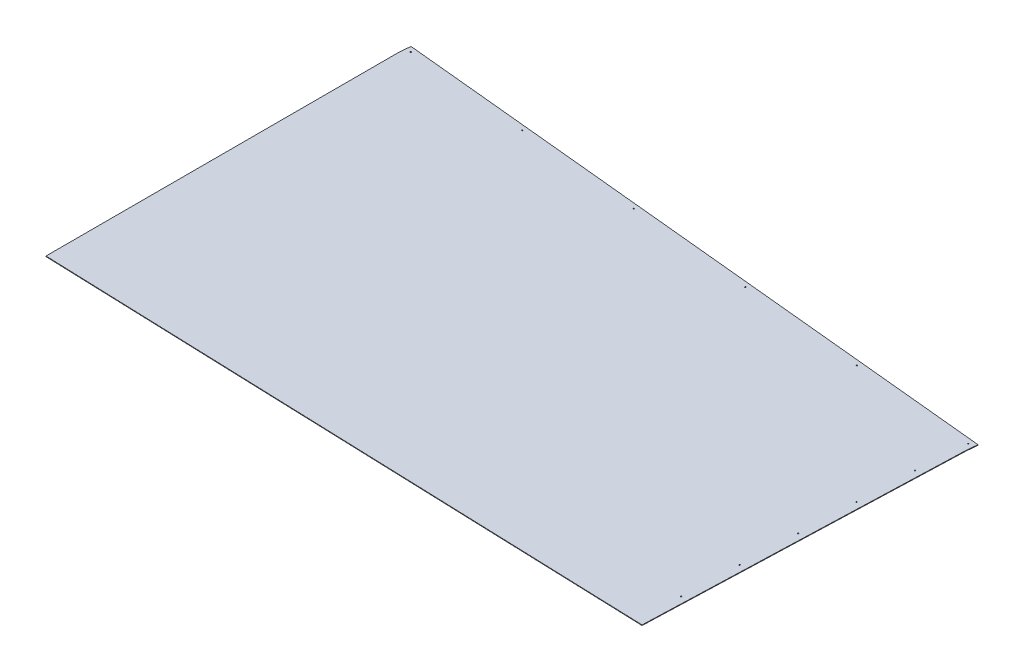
ISO-10303-21;
HEADER;
FILE_DESCRIPTION(('STEP AP214'),'2;1');
FILE_NAME('part.step','',(''),(''),'','','');
FILE_SCHEMA(('AUTOMOTIVE_DESIGN { 1 0 10303 214 1 1 1 1 }'));
ENDSEC;
DATA;
#1=APPLICATION_CONTEXT('core data for automotive mechanical design processes');
#2=APPLICATION_PROTOCOL_DEFINITION('international standard','automotive_design',2000,#1);
#3=PRODUCT_CONTEXT('',#1,'mechanical');
#4=PRODUCT('Part','Part','',(#3));
#5=PRODUCT_RELATED_PRODUCT_CATEGORY('part','',(#4));
#6=PRODUCT_DEFINITION_FORMATION('','',#4);
#7=PRODUCT_DEFINITION_CONTEXT('part definition',#1,'design');
#8=PRODUCT_DEFINITION('design','',#6,#7);
#9=PRODUCT_DEFINITION_SHAPE('','',#8);
#10=(LENGTH_UNIT() NAMED_UNIT(*) SI_UNIT(.MILLI.,.METRE.));
#11=(NAMED_UNIT(*) PLANE_ANGLE_UNIT() SI_UNIT($,.RADIAN.));
#12=(NAMED_UNIT(*) SI_UNIT($,.STERADIAN.) SOLID_ANGLE_UNIT());
#13=UNCERTAINTY_MEASURE_WITH_UNIT(LENGTH_MEASURE(1.E-05),#10,'distance_accuracy_value','');
#14=(GEOMETRIC_REPRESENTATION_CONTEXT(3) GLOBAL_UNCERTAINTY_ASSIGNED_CONTEXT((#13)) GLOBAL_UNIT_ASSIGNED_CONTEXT((#10,
#11,#12)) REPRESENTATION_CONTEXT('',''));
#15=CARTESIAN_POINT('',(0.,0.,0.));
#16=DIRECTION('',(0.,0.,1.));
#17=DIRECTION('',(1.,0.,0.));
#18=AXIS2_PLACEMENT_3D('',#15,#16,#17);
#19=CARTESIAN_POINT('',(-2536.23276450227,-2.5399999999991,-1605.09933253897));
#20=DIRECTION('',(0.,1.,0.));
#21=DIRECTION('',(-0.995256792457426,0.,-0.0972826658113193));
#22=AXIS2_PLACEMENT_3D('',#19,#20,#21);
#23=CYLINDRICAL_SURFACE('',#22,1.58749999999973);
#24=CARTESIAN_POINT('',(-2536.23276450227,8.88178419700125E-13,-1605.09933253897));
#25=DIRECTION('',(0.,1.,0.));
#26=DIRECTION('',(-0.995256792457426,0.,-0.0972826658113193));
#27=AXIS2_PLACEMENT_3D('',#24,#25,#26);
#28=CIRCLE('',#27,1.58749999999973);
#29=CARTESIAN_POINT('',(-2537.8127346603,8.90425580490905E-13,-1605.25376877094));
#30=VERTEX_POINT('',#29);
#31=EDGE_CURVE('E198',#30,#30,#28,.T.);
#32=ORIENTED_EDGE('',*,*,#31,.T.);
#33=EDGE_LOOP('',(#32));
#34=FACE_BOUND('',#33,.T.);
#35=CARTESIAN_POINT('',(-2536.23276450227,-1.62559999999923,-1605.09933253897));
#36=DIRECTION('',(0.,1.,0.));
#37=DIRECTION('',(-0.995256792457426,0.,-0.0972826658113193));
#38=AXIS2_PLACEMENT_3D('',#35,#36,#37);
#39=CIRCLE('',#38,1.58749999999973);
#40=CARTESIAN_POINT('',(-2537.8127346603,-1.62559999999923,-1605.25376877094));
#41=VERTEX_POINT('',#40);
#42=EDGE_CURVE('E202',#41,#41,#39,.T.);
#43=ORIENTED_EDGE('',*,*,#42,.F.);
#44=EDGE_LOOP('',(#43));
#45=FACE_BOUND('',#44,.T.);
#46=ADVANCED_FACE('F99',(#34,#45),#23,.F.);
#47=CARTESIAN_POINT('',(-2182.31944910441,-2.53999999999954,-1570.50561657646));
#48=DIRECTION('',(0.,1.,0.));
#49=DIRECTION('',(-0.995256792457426,0.,-0.0972826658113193));
#50=AXIS2_PLACEMENT_3D('',#47,#48,#49);
#51=CYLINDRICAL_SURFACE('',#50,1.58750000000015);
#52=CARTESIAN_POINT('',(-2182.31944910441,4.44089209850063E-13,-1570.50561657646));
#53=DIRECTION('',(0.,1.,0.));
#54=DIRECTION('',(-0.995256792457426,0.,-0.0972826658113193));
#55=AXIS2_PLACEMENT_3D('',#52,#53,#54);
#56=CIRCLE('',#55,1.58750000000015);
#57=CARTESIAN_POINT('',(-2183.89941926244,4.46336370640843E-13,-1570.66005280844));
#58=VERTEX_POINT('',#57);
#59=EDGE_CURVE('E241',#58,#58,#56,.T.);
#60=ORIENTED_EDGE('',*,*,#59,.T.);
#61=EDGE_LOOP('',(#60));
#62=FACE_BOUND('',#61,.T.);
#63=CARTESIAN_POINT('',(-2182.31944910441,-1.62560000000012,-1570.50561657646));
#64=DIRECTION('',(0.,1.,0.));
#65=DIRECTION('',(-0.995256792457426,0.,-0.0972826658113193));
#66=AXIS2_PLACEMENT_3D('',#63,#64,#65);
#67=CIRCLE('',#66,1.58750000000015);
#68=CARTESIAN_POINT('',(-2183.89941926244,-1.62560000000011,-1570.66005280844));
#69=VERTEX_POINT('',#68);
#70=EDGE_CURVE('E205',#69,#69,#67,.T.);
#71=ORIENTED_EDGE('',*,*,#70,.F.);
#72=EDGE_LOOP('',(#71));
#73=FACE_BOUND('',#72,.T.);
#74=ADVANCED_FACE('F273',(#62,#73),#51,.F.);
#75=CARTESIAN_POINT('',(-1828.40613370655,-2.53999999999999,-1535.91190061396));
#76=DIRECTION('',(0.,1.,0.));
#77=DIRECTION('',(-0.995256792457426,0.,-0.0972826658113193));
#78=AXIS2_PLACEMENT_3D('',#75,#76,#77);
#79=CYLINDRICAL_SURFACE('',#78,1.58750000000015);
#80=CARTESIAN_POINT('',(-1828.40613370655,-4.44089209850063E-13,-1535.91190061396));
#81=DIRECTION('',(0.,1.,0.));
#82=DIRECTION('',(-0.995256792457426,0.,-0.0972826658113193));
#83=AXIS2_PLACEMENT_3D('',#80,#81,#82);
#84=CIRCLE('',#83,1.58750000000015);
#85=CARTESIAN_POINT('',(-1829.98610386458,-4.41842049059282E-13,-1536.06633684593));
#86=VERTEX_POINT('',#85);
#87=EDGE_CURVE('E238',#86,#86,#84,.T.);
#88=ORIENTED_EDGE('',*,*,#87,.T.);
#89=EDGE_LOOP('',(#88));
#90=FACE_BOUND('',#89,.T.);
#91=CARTESIAN_POINT('',(-1828.40613370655,-1.62560000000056,-1535.91190061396));
#92=DIRECTION('',(0.,1.,0.));
#93=DIRECTION('',(-0.995256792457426,0.,-0.0972826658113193));
#94=AXIS2_PLACEMENT_3D('',#91,#92,#93);
#95=CIRCLE('',#94,1.58750000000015);
#96=CARTESIAN_POINT('',(-1829.98610386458,-1.62560000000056,-1536.06633684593));
#97=VERTEX_POINT('',#96);
#98=EDGE_CURVE('E208',#97,#97,#95,.T.);
#99=ORIENTED_EDGE('',*,*,#98,.F.);
#100=EDGE_LOOP('',(#99));
#101=FACE_BOUND('',#100,.T.);
#102=ADVANCED_FACE('F279',(#90,#101),#79,.F.);
#103=CARTESIAN_POINT('',(-1474.49281830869,-2.54000000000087,-1501.31818465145));
#104=DIRECTION('',(0.,1.,0.));
#105=DIRECTION('',(-0.995256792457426,0.,-0.0972826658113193));
#106=AXIS2_PLACEMENT_3D('',#103,#104,#105);
#107=CYLINDRICAL_SURFACE('',#106,1.58749999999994);
#108=CARTESIAN_POINT('',(-1474.49281830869,-8.88178419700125E-13,-1501.31818465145));
#109=DIRECTION('',(0.,1.,0.));
#110=DIRECTION('',(-0.995256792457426,0.,-0.0972826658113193));
#111=AXIS2_PLACEMENT_3D('',#108,#109,#110);
#112=CIRCLE('',#111,1.58749999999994);
#113=CARTESIAN_POINT('',(-1476.07278846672,-8.85931258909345E-13,-1501.47262088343));
#114=VERTEX_POINT('',#113);
#115=EDGE_CURVE('E235',#114,#114,#112,.T.);
#116=ORIENTED_EDGE('',*,*,#115,.T.);
#117=EDGE_LOOP('',(#116));
#118=FACE_BOUND('',#117,.T.);
#119=CARTESIAN_POINT('',(-1474.49281830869,-1.625600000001,-1501.31818465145));
#120=DIRECTION('',(0.,1.,0.));
#121=DIRECTION('',(-0.995256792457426,0.,-0.0972826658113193));
#122=AXIS2_PLACEMENT_3D('',#119,#120,#121);
#123=CIRCLE('',#122,1.58749999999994);
#124=CARTESIAN_POINT('',(-1476.07278846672,-1.625600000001,-1501.47262088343));
#125=VERTEX_POINT('',#124);
#126=EDGE_CURVE('E211',#125,#125,#123,.T.);
#127=ORIENTED_EDGE('',*,*,#126,.F.);
#128=EDGE_LOOP('',(#127));
#129=FACE_BOUND('',#128,.T.);
#130=ADVANCED_FACE('F288',(#118,#129),#107,.F.);
#131=CARTESIAN_POINT('',(-1120.57950291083,-2.54000000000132,-1466.72446868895));
#132=DIRECTION('',(0.,1.,0.));
#133=DIRECTION('',(-0.995256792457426,0.,-0.0972826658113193));
#134=AXIS2_PLACEMENT_3D('',#131,#132,#133);
#135=CYLINDRICAL_SURFACE('',#134,1.58749999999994);
#136=CARTESIAN_POINT('',(-1120.57950291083,-1.33226762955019E-12,-1466.72446868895));
#137=DIRECTION('',(0.,1.,0.));
#138=DIRECTION('',(-0.995256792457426,0.,-0.0972826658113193));
#139=AXIS2_PLACEMENT_3D('',#136,#137,#138);
#140=CIRCLE('',#139,1.58749999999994);
#141=CARTESIAN_POINT('',(-1122.15947306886,-1.33002046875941E-12,-1466.87890492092));
#142=VERTEX_POINT('',#141);
#143=EDGE_CURVE('E232',#142,#142,#140,.T.);
#144=ORIENTED_EDGE('',*,*,#143,.T.);
#145=EDGE_LOOP('',(#144));
#146=FACE_BOUND('',#145,.T.);
#147=CARTESIAN_POINT('',(-1120.57950291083,-1.62560000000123,-1466.72446868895));
#148=DIRECTION('',(0.,1.,0.));
#149=DIRECTION('',(-0.995256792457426,0.,-0.0972826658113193));
#150=AXIS2_PLACEMENT_3D('',#147,#148,#149);
#151=CIRCLE('',#150,1.58749999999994);
#152=CARTESIAN_POINT('',(-1122.15947306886,-1.62560000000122,-1466.87890492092));
#153=VERTEX_POINT('',#152);
#154=EDGE_CURVE('E214',#153,#153,#151,.T.);
#155=ORIENTED_EDGE('',*,*,#154,.F.);
#156=EDGE_LOOP('',(#155));
#157=FACE_BOUND('',#156,.T.);
#158=ADVANCED_FACE('F292',(#146,#157),#135,.F.);
#159=CARTESIAN_POINT('',(-766.666187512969,-2.54000000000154,-1432.13075272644));
#160=DIRECTION('',(0.,1.,0.));
#161=DIRECTION('',(-0.995256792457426,0.,-0.0972826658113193));
#162=AXIS2_PLACEMENT_3D('',#159,#160,#161);
#163=CYLINDRICAL_SURFACE('',#162,1.58749999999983);
#164=CARTESIAN_POINT('',(-766.666187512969,-1.55431223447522E-12,-1432.13075272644));
#165=DIRECTION('',(0.,1.,0.));
#166=DIRECTION('',(-0.995256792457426,0.,-0.0972826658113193));
#167=AXIS2_PLACEMENT_3D('',#164,#165,#166);
#168=CIRCLE('',#167,1.58749999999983);
#169=CARTESIAN_POINT('',(-768.246157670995,-1.55206507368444E-12,-1432.28518895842));
#170=VERTEX_POINT('',#169);
#171=EDGE_CURVE('E229',#170,#170,#168,.T.);
#172=ORIENTED_EDGE('',*,*,#171,.T.);
#173=EDGE_LOOP('',(#172));
#174=FACE_BOUND('',#173,.T.);
#175=CARTESIAN_POINT('',(-766.666187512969,-1.62560000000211,-1432.13075272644));
#176=DIRECTION('',(0.,1.,0.));
#177=DIRECTION('',(-0.995256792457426,0.,-0.0972826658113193));
#178=AXIS2_PLACEMENT_3D('',#175,#176,#177);
#179=CIRCLE('',#178,1.58749999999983);
#180=CARTESIAN_POINT('',(-768.246157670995,-1.62560000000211,-1432.28518895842));
#181=VERTEX_POINT('',#180);
#182=EDGE_CURVE('E217',#181,#181,#179,.T.);
#183=ORIENTED_EDGE('',*,*,#182,.F.);
#184=EDGE_LOOP('',(#183));
#185=FACE_BOUND('',#184,.T.);
#186=ADVANCED_FACE('F270',(#174,#185),#163,.F.);
#187=CARTESIAN_POINT('',(2192.56312068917,-3628.55544699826,-1155.63757233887));
#188=DIRECTION('',(0.0972826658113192,0.,-0.995256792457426));
#189=DIRECTION('',(-0.995256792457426,0.,-0.0972826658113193));
#190=AXIS2_PLACEMENT_3D('',#187,#188,#189);
#191=PLANE('',#190);
#192=DIRECTION('',(0.,1.,0.));
#193=VECTOR('',#192,1.);
#194=CARTESIAN_POINT('',(-2549.71308850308,-3628.55544699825,-1619.17751011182));
#195=LINE('',#194,#193);
#196=CARTESIAN_POINT('',(-2549.71308850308,-1.62559999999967,-1619.17751011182));
#197=VERTEX_POINT('',#196);
#198=CARTESIAN_POINT('',(-2549.71308850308,8.88178419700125E-13,-1619.17751011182));
#199=VERTEX_POINT('',#198);
#200=EDGE_CURVE('E227',#197,#199,#195,.T.);
#201=ORIENTED_EDGE('',*,*,#200,.T.);
#202=DIRECTION('',(0.995256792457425,0.,0.0972826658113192));
#203=VECTOR('',#202,1.);
#204=CARTESIAN_POINT('',(2192.56312068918,-5.99520433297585E-12,-1155.63757233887));
#205=LINE('',#204,#203);
#206=CARTESIAN_POINT('',(-750.556732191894,-1.33226762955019E-12,-1443.31663894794));
#207=VERTEX_POINT('',#206);
#208=EDGE_CURVE('E225',#199,#207,#205,.T.);
#209=ORIENTED_EDGE('',*,*,#208,.T.);
#210=DIRECTION('',(0.,1.,0.));
#211=VECTOR('',#210,1.);
#212=CARTESIAN_POINT('',(-750.556732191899,-3628.55544699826,-1443.31663894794));
#213=LINE('',#212,#211);
#214=CARTESIAN_POINT('',(-750.556732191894,-1.62560000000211,-1443.31663894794));
#215=VERTEX_POINT('',#214);
#216=EDGE_CURVE('E221',#215,#207,#213,.T.);
#217=ORIENTED_EDGE('',*,*,#216,.F.);
#218=DIRECTION('',(-0.995256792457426,0.,-0.0972826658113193));
#219=VECTOR('',#218,1.);
#220=CARTESIAN_POINT('',(2192.56312068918,-1.62560000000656,-1155.63757233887));
#221=LINE('',#220,#219);
#222=EDGE_CURVE('E136',#215,#197,#221,.T.);
#223=ORIENTED_EDGE('',*,*,#222,.T.);
#224=EDGE_LOOP('',(#201,#209,#217,#223));
#225=FACE_BOUND('',#224,.T.);
#226=ADVANCED_FACE('F260',(#225),#191,.T.);
#227=CARTESIAN_POINT('',(-2552.80181314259,-3628.55544699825,-1587.57810695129));
#228=DIRECTION('',(0.995256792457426,0.,0.0972826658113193));
#229=DIRECTION('',(0.0972826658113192,0.,-0.995256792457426));
#230=AXIS2_PLACEMENT_3D('',#227,#228,#229);
#231=PLANE('',#230);
#232=DIRECTION('',(-0.0972826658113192,0.,0.995256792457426));
#233=VECTOR('',#232,1.);
#234=CARTESIAN_POINT('',(-2552.80181314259,4.44089209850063E-13,-1587.57810695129));
#235=LINE('',#234,#233);
#236=CARTESIAN_POINT('',(-2552.7,3.28296417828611E-13,-1588.61971308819));
#237=VERTEX_POINT('',#236);
#238=EDGE_CURVE('E150',#199,#237,#235,.T.);
#239=ORIENTED_EDGE('',*,*,#238,.F.);
#240=ORIENTED_EDGE('',*,*,#200,.F.);
#241=DIRECTION('',(0.0972826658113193,0.,-0.995256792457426));
#242=VECTOR('',#241,1.);
#243=CARTESIAN_POINT('',(-2552.80181314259,-1.62559999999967,-1587.57810695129));
#244=LINE('',#243,#242);
#245=CARTESIAN_POINT('',(-2552.7,-1.62559999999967,-1588.61971308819));
#246=VERTEX_POINT('',#245);
#247=EDGE_CURVE('E13',#246,#197,#244,.T.);
#248=ORIENTED_EDGE('',*,*,#247,.F.);
#249=DIRECTION('',(0.,-1.,0.));
#250=VECTOR('',#249,1.);
#251=CARTESIAN_POINT('',(-2552.7,-0.812799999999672,-1588.61971308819));
#252=LINE('',#251,#250);
#253=EDGE_CURVE('E174',#237,#246,#252,.T.);
#254=ORIENTED_EDGE('',*,*,#253,.F.);
#255=EDGE_LOOP('',(#239,#240,#248,#254));
#256=FACE_BOUND('',#255,.T.);
#257=ADVANCED_FACE('F262',(#256),#231,.F.);
#258=CARTESIAN_POINT('',(129.551766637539,-3.33066907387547E-12,-1325.38797786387));
#259=DIRECTION('',(0.,1.,0.));
#260=DIRECTION('',(-0.995256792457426,0.,-0.0972826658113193));
#261=AXIS2_PLACEMENT_3D('',#258,#259,#260);
#262=PLANE('',#261);
#263=ORIENTED_EDGE('',*,*,#238,.T.);
#264=DIRECTION('',(0.,0.,1.));
#265=VECTOR('',#264,1.);
#266=CARTESIAN_POINT('',(-2552.7,3.28296417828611E-13,-1500.95976312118));
#267=LINE('',#266,#265);
#268=CARTESIAN_POINT('',(-2552.7,-1.77635683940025E-12,-576.950850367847));
#269=VERTEX_POINT('',#268);
#270=EDGE_CURVE('E184',#269,#237,#267,.F.);
#271=ORIENTED_EDGE('',*,*,#270,.F.);
#272=DIRECTION('',(0.999396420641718,0.,0.0347389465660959));
#273=VECTOR('',#272,1.);
#274=CARTESIAN_POINT('',(2571.71966629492,0.,-398.82639715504));
#275=LINE('',#274,#273);
#276=CARTESIAN_POINT('',(-784.630637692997,0.,-515.492888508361));
#277=VERTEX_POINT('',#276);
#278=EDGE_CURVE('E183',#269,#277,#275,.T.);
#279=ORIENTED_EDGE('',*,*,#278,.T.);
#280=DIRECTION('',(-0.0347389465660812,0.,0.999396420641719));
#281=VECTOR('',#280,1.);
#282=CARTESIAN_POINT('',(-753.385500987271,3.37403716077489E-13,-1414.37673136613));
#283=LINE('',#282,#281);
#284=CARTESIAN_POINT('',(-753.385500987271,3.37403716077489E-13,-1414.37673136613));
#285=VERTEX_POINT('',#284);
#286=EDGE_CURVE('E158',#285,#277,#283,.T.);
#287=ORIENTED_EDGE('',*,*,#286,.F.);
#288=DIRECTION('',(-0.0972826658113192,0.,0.995256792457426));
#289=VECTOR('',#288,1.);
#290=CARTESIAN_POINT('',(-753.645456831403,-2.22044604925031E-12,-1411.71723578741));
#291=LINE('',#290,#289);
#292=EDGE_CURVE('E129',#207,#285,#291,.T.);
#293=ORIENTED_EDGE('',*,*,#292,.F.);
#294=ORIENTED_EDGE('',*,*,#208,.F.);
#295=EDGE_LOOP('',(#263,#271,#279,#287,#293,#294));
#296=FACE_BOUND('',#295,.T.);
#297=ORIENTED_EDGE('',*,*,#171,.F.);
#298=EDGE_LOOP('',(#297));
#299=FACE_BOUND('',#298,.T.);
#300=ORIENTED_EDGE('',*,*,#143,.F.);
#301=EDGE_LOOP('',(#300));
#302=FACE_BOUND('',#301,.T.);
#303=ORIENTED_EDGE('',*,*,#115,.F.);
#304=EDGE_LOOP('',(#303));
#305=FACE_BOUND('',#304,.T.);
#306=ORIENTED_EDGE('',*,*,#87,.F.);
#307=EDGE_LOOP('',(#306));
#308=FACE_BOUND('',#307,.T.);
#309=ORIENTED_EDGE('',*,*,#59,.F.);
#310=EDGE_LOOP('',(#309));
#311=FACE_BOUND('',#310,.T.);
#312=ORIENTED_EDGE('',*,*,#31,.F.);
#313=EDGE_LOOP('',(#312));
#314=FACE_BOUND('',#313,.T.);
#315=CARTESIAN_POINT('',(-799.296778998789,0.,-641.942056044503));
#316=DIRECTION('',(0.,1.,0.));
#317=DIRECTION('',(-1.,0.,0.));
#318=AXIS2_PLACEMENT_3D('',#315,#316,#317);
#319=CIRCLE('',#318,1.58750000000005);
#320=CARTESIAN_POINT('',(-800.88427899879,0.,-641.942056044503));
#321=VERTEX_POINT('',#320);
#322=EDGE_CURVE('E548',#321,#321,#319,.F.);
#323=ORIENTED_EDGE('',*,*,#322,.T.);
#324=EDGE_LOOP('',(#323));
#325=FACE_BOUND('',#324,.T.);
#326=CARTESIAN_POINT('',(-793.671675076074,0.,-803.769321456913));
#327=DIRECTION('',(0.,1.,0.));
#328=DIRECTION('',(-1.,0.,0.));
#329=AXIS2_PLACEMENT_3D('',#326,#327,#328);
#330=CIRCLE('',#329,1.58750000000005);
#331=CARTESIAN_POINT('',(-795.259175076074,0.,-803.769321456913));
#332=VERTEX_POINT('',#331);
#333=EDGE_CURVE('E545',#332,#332,#330,.F.);
#334=ORIENTED_EDGE('',*,*,#333,.T.);
#335=EDGE_LOOP('',(#334));
#336=FACE_BOUND('',#335,.T.);
#337=CARTESIAN_POINT('',(-788.046571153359,0.,-965.596586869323));
#338=DIRECTION('',(0.,1.,0.));
#339=DIRECTION('',(-1.,0.,0.));
#340=AXIS2_PLACEMENT_3D('',#337,#338,#339);
#341=CIRCLE('',#340,1.58750000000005);
#342=CARTESIAN_POINT('',(-789.634071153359,0.,-965.596586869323));
#343=VERTEX_POINT('',#342);
#344=EDGE_CURVE('E540',#343,#343,#341,.F.);
#345=ORIENTED_EDGE('',*,*,#344,.T.);
#346=EDGE_LOOP('',(#345));
#347=FACE_BOUND('',#346,.T.);
#348=CARTESIAN_POINT('',(-782.421467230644,0.,-1127.42385228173));
#349=DIRECTION('',(0.,1.,0.));
#350=DIRECTION('',(-1.,0.,0.));
#351=AXIS2_PLACEMENT_3D('',#348,#349,#350);
#352=CIRCLE('',#351,1.58750000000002);
#353=CARTESIAN_POINT('',(-784.008967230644,0.,-1127.42385228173));
#354=VERTEX_POINT('',#353);
#355=EDGE_CURVE('E537',#354,#354,#352,.F.);
#356=ORIENTED_EDGE('',*,*,#355,.T.);
#357=EDGE_LOOP('',(#356));
#358=FACE_BOUND('',#357,.T.);
#359=CARTESIAN_POINT('',(-776.796363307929,0.,-1289.25111769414));
#360=DIRECTION('',(0.,1.,0.));
#361=DIRECTION('',(-1.,0.,0.));
#362=AXIS2_PLACEMENT_3D('',#359,#360,#361);
#363=CIRCLE('',#362,1.58750000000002);
#364=CARTESIAN_POINT('',(-778.383863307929,0.,-1289.25111769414));
#365=VERTEX_POINT('',#364);
#366=EDGE_CURVE('E256',#365,#365,#363,.F.);
#367=ORIENTED_EDGE('',*,*,#366,.T.);
#368=EDGE_LOOP('',(#367));
#369=FACE_BOUND('',#368,.T.);
#370=ADVANCED_FACE('F254',(#296,#299,#302,#305,#308,#311,#314,#325,#336,#347,#358,#369),#262,.T.);
#371=CARTESIAN_POINT('',(-753.645456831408,-3628.55544699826,-1411.71723578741));
#372=DIRECTION('',(0.995256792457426,0.,0.0972826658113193));
#373=DIRECTION('',(0.0972826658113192,0.,-0.995256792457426));
#374=AXIS2_PLACEMENT_3D('',#371,#372,#373);
#375=PLANE('',#374);
#376=ORIENTED_EDGE('',*,*,#216,.T.);
#377=ORIENTED_EDGE('',*,*,#292,.T.);
#378=DIRECTION('',(0.,-1.,0.));
#379=VECTOR('',#378,1.);
#380=CARTESIAN_POINT('',(-753.385500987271,-0.812799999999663,-1414.37673136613));
#381=LINE('',#380,#379);
#382=CARTESIAN_POINT('',(-753.385500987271,-1.62559999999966,-1414.37673136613));
#383=VERTEX_POINT('',#382);
#384=EDGE_CURVE('E199',#285,#383,#381,.T.);
#385=ORIENTED_EDGE('',*,*,#384,.T.);
#386=DIRECTION('',(-0.0972826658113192,0.,0.995256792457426));
#387=VECTOR('',#386,1.);
#388=CARTESIAN_POINT('',(-753.645456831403,-1.62560000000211,-1411.71723578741));
#389=LINE('',#388,#387);
#390=EDGE_CURVE('E109',#215,#383,#389,.T.);
#391=ORIENTED_EDGE('',*,*,#390,.F.);
#392=EDGE_LOOP('',(#376,#377,#385,#391));
#393=FACE_BOUND('',#392,.T.);
#394=ADVANCED_FACE('F259',(#393),#375,.T.);
#395=CARTESIAN_POINT('',(0.,-1.6256,0.));
#396=DIRECTION('',(0.,1.,0.));
#397=DIRECTION('',(-1.,0.,0.));
#398=AXIS2_PLACEMENT_3D('',#395,#396,#397);
#399=PLANE('',#398);
#400=ORIENTED_EDGE('',*,*,#182,.T.);
#401=EDGE_LOOP('',(#400));
#402=FACE_BOUND('',#401,.T.);
#403=ORIENTED_EDGE('',*,*,#154,.T.);
#404=EDGE_LOOP('',(#403));
#405=FACE_BOUND('',#404,.T.);
#406=ORIENTED_EDGE('',*,*,#126,.T.);
#407=EDGE_LOOP('',(#406));
#408=FACE_BOUND('',#407,.T.);
#409=ORIENTED_EDGE('',*,*,#98,.T.);
#410=EDGE_LOOP('',(#409));
#411=FACE_BOUND('',#410,.T.);
#412=ORIENTED_EDGE('',*,*,#70,.T.);
#413=EDGE_LOOP('',(#412));
#414=FACE_BOUND('',#413,.T.);
#415=ORIENTED_EDGE('',*,*,#42,.T.);
#416=EDGE_LOOP('',(#415));
#417=FACE_BOUND('',#416,.T.);
#418=ORIENTED_EDGE('',*,*,#390,.T.);
#419=DIRECTION('',(-0.0347389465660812,0.,0.999396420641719));
#420=VECTOR('',#419,1.);
#421=CARTESIAN_POINT('',(-753.385500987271,-1.62559999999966,-1414.37673136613));
#422=LINE('',#421,#420);
#423=CARTESIAN_POINT('',(-784.630637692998,-1.62560000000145,-515.492888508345));
#424=VERTEX_POINT('',#423);
#425=EDGE_CURVE('E176',#383,#424,#422,.T.);
#426=ORIENTED_EDGE('',*,*,#425,.T.);
#427=DIRECTION('',(0.999396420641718,0.,0.0347389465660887));
#428=VECTOR('',#427,1.);
#429=CARTESIAN_POINT('',(-2552.7,-1.62560000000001,-576.950850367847));
#430=LINE('',#429,#428);
#431=CARTESIAN_POINT('',(-2552.7,-1.62560000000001,-576.950850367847));
#432=VERTEX_POINT('',#431);
#433=EDGE_CURVE('E182',#432,#424,#430,.T.);
#434=ORIENTED_EDGE('',*,*,#433,.F.);
#435=DIRECTION('',(0.,0.,1.));
#436=VECTOR('',#435,1.);
#437=CARTESIAN_POINT('',(-2552.7,-1.62559999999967,-1500.95976312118));
#438=LINE('',#437,#436);
#439=EDGE_CURVE('E169',#432,#246,#438,.F.);
#440=ORIENTED_EDGE('',*,*,#439,.T.);
#441=ORIENTED_EDGE('',*,*,#247,.T.);
#442=ORIENTED_EDGE('',*,*,#222,.F.);
#443=EDGE_LOOP('',(#418,#426,#434,#440,#441,#442));
#444=FACE_BOUND('',#443,.T.);
#445=CARTESIAN_POINT('',(-776.796363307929,-1.6256,-1289.25111769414));
#446=DIRECTION('',(0.,-1.,0.));
#447=DIRECTION('',(1.,0.,0.));
#448=AXIS2_PLACEMENT_3D('',#445,#446,#447);
#449=CIRCLE('',#448,1.58750000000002);
#450=CARTESIAN_POINT('',(-775.208863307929,-1.6256,-1289.25111769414));
#451=VERTEX_POINT('',#450);
#452=EDGE_CURVE('E533',#451,#451,#449,.T.);
#453=ORIENTED_EDGE('',*,*,#452,.F.);
#454=EDGE_LOOP('',(#453));
#455=FACE_BOUND('',#454,.T.);
#456=CARTESIAN_POINT('',(-782.421467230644,-1.6256,-1127.42385228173));
#457=DIRECTION('',(0.,-1.,0.));
#458=DIRECTION('',(1.,0.,0.));
#459=AXIS2_PLACEMENT_3D('',#456,#457,#458);
#460=CIRCLE('',#459,1.58750000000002);
#461=CARTESIAN_POINT('',(-780.833967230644,-1.6256,-1127.42385228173));
#462=VERTEX_POINT('',#461);
#463=EDGE_CURVE('E552',#462,#462,#460,.T.);
#464=ORIENTED_EDGE('',*,*,#463,.F.);
#465=EDGE_LOOP('',(#464));
#466=FACE_BOUND('',#465,.T.);
#467=CARTESIAN_POINT('',(-788.046571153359,-1.6256,-965.596586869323));
#468=DIRECTION('',(0.,-1.,0.));
#469=DIRECTION('',(1.,0.,0.));
#470=AXIS2_PLACEMENT_3D('',#467,#468,#469);
#471=CIRCLE('',#470,1.58750000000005);
#472=CARTESIAN_POINT('',(-786.459071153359,-1.6256,-965.596586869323));
#473=VERTEX_POINT('',#472);
#474=EDGE_CURVE('E555',#473,#473,#471,.T.);
#475=ORIENTED_EDGE('',*,*,#474,.F.);
#476=EDGE_LOOP('',(#475));
#477=FACE_BOUND('',#476,.T.);
#478=CARTESIAN_POINT('',(-793.671675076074,-1.6256,-803.769321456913));
#479=DIRECTION('',(0.,-1.,0.));
#480=DIRECTION('',(1.,0.,0.));
#481=AXIS2_PLACEMENT_3D('',#478,#479,#480);
#482=CIRCLE('',#481,1.58750000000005);
#483=CARTESIAN_POINT('',(-792.084175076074,-1.6256,-803.769321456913));
#484=VERTEX_POINT('',#483);
#485=EDGE_CURVE('E192',#484,#484,#482,.T.);
#486=ORIENTED_EDGE('',*,*,#485,.F.);
#487=EDGE_LOOP('',(#486));
#488=FACE_BOUND('',#487,.T.);
#489=CARTESIAN_POINT('',(-799.296778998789,-1.6256,-641.942056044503));
#490=DIRECTION('',(0.,-1.,0.));
#491=DIRECTION('',(1.,0.,0.));
#492=AXIS2_PLACEMENT_3D('',#489,#490,#491);
#493=CIRCLE('',#492,1.58750000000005);
#494=CARTESIAN_POINT('',(-797.709278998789,-1.6256,-641.942056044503));
#495=VERTEX_POINT('',#494);
#496=EDGE_CURVE('E188',#495,#495,#493,.T.);
#497=ORIENTED_EDGE('',*,*,#496,.F.);
#498=EDGE_LOOP('',(#497));
#499=FACE_BOUND('',#498,.T.);
#500=ADVANCED_FACE('F101',(#402,#405,#408,#411,#414,#417,#444,#455,#466,#477,#488,#499),#399,.F.);
#501=CARTESIAN_POINT('',(-2552.7,-0.812799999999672,-1500.95976312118));
#502=DIRECTION('',(1.,0.,0.));
#503=DIRECTION('',(0.,0.,1.));
#504=AXIS2_PLACEMENT_3D('',#501,#502,#503);
#505=PLANE('',#504);
#506=ORIENTED_EDGE('',*,*,#439,.F.);
#507=DIRECTION('',(0.,1.,0.));
#508=VECTOR('',#507,1.);
#509=CARTESIAN_POINT('',(-2552.7,-4189.81074877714,-576.950850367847));
#510=LINE('',#509,#508);
#511=EDGE_CURVE('E173',#432,#269,#510,.T.);
#512=ORIENTED_EDGE('',*,*,#511,.T.);
#513=ORIENTED_EDGE('',*,*,#270,.T.);
#514=ORIENTED_EDGE('',*,*,#253,.T.);
#515=EDGE_LOOP('',(#506,#512,#513,#514));
#516=FACE_BOUND('',#515,.T.);
#517=ADVANCED_FACE('F171',(#516),#505,.F.);
#518=CARTESIAN_POINT('',(-753.385500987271,-0.812799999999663,-1414.37673136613));
#519=DIRECTION('',(0.999396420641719,0.,0.0347389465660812));
#520=DIRECTION('',(-0.0347389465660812,0.,0.999396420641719));
#521=AXIS2_PLACEMENT_3D('',#518,#519,#520);
#522=PLANE('',#521);
#523=ORIENTED_EDGE('',*,*,#286,.T.);
#524=DIRECTION('',(0.,1.,0.));
#525=VECTOR('',#524,1.);
#526=CARTESIAN_POINT('',(-784.630637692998,-4189.81074877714,-515.492888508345));
#527=LINE('',#526,#525);
#528=EDGE_CURVE('E189',#424,#277,#527,.T.);
#529=ORIENTED_EDGE('',*,*,#528,.F.);
#530=ORIENTED_EDGE('',*,*,#425,.F.);
#531=ORIENTED_EDGE('',*,*,#384,.F.);
#532=EDGE_LOOP('',(#523,#529,#530,#531));
#533=FACE_BOUND('',#532,.T.);
#534=ADVANCED_FACE('F258',(#533),#522,.T.);
#535=CARTESIAN_POINT('',(-2552.7,-4189.81074877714,-576.950850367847));
#536=DIRECTION('',(-0.0347389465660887,0.,0.999396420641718));
#537=DIRECTION('',(0.999396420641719,0.,0.0347389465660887));
#538=AXIS2_PLACEMENT_3D('',#535,#536,#537);
#539=PLANE('',#538);
#540=ORIENTED_EDGE('',*,*,#528,.T.);
#541=ORIENTED_EDGE('',*,*,#278,.F.);
#542=ORIENTED_EDGE('',*,*,#511,.F.);
#543=ORIENTED_EDGE('',*,*,#433,.T.);
#544=EDGE_LOOP('',(#540,#541,#542,#543));
#545=FACE_BOUND('',#544,.T.);
#546=ADVANCED_FACE('F181',(#545),#539,.T.);
#547=CARTESIAN_POINT('',(-799.296778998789,4.49012806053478,-641.942056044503));
#548=DIRECTION('',(0.,-1.,0.));
#549=DIRECTION('',(1.,0.,0.));
#550=AXIS2_PLACEMENT_3D('',#547,#548,#549);
#551=CYLINDRICAL_SURFACE('',#550,1.58750000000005);
#552=ORIENTED_EDGE('',*,*,#496,.T.);
#553=EDGE_LOOP('',(#552));
#554=FACE_BOUND('',#553,.T.);
#555=ORIENTED_EDGE('',*,*,#322,.F.);
#556=EDGE_LOOP('',(#555));
#557=FACE_BOUND('',#556,.T.);
#558=ADVANCED_FACE('F369',(#554,#557),#551,.F.);
#559=CARTESIAN_POINT('',(-793.671675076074,4.49012806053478,-803.769321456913));
#560=DIRECTION('',(0.,-1.,0.));
#561=DIRECTION('',(1.,0.,0.));
#562=AXIS2_PLACEMENT_3D('',#559,#560,#561);
#563=CYLINDRICAL_SURFACE('',#562,1.58750000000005);
#564=ORIENTED_EDGE('',*,*,#485,.T.);
#565=EDGE_LOOP('',(#564));
#566=FACE_BOUND('',#565,.T.);
#567=ORIENTED_EDGE('',*,*,#333,.F.);
#568=EDGE_LOOP('',(#567));
#569=FACE_BOUND('',#568,.T.);
#570=ADVANCED_FACE('F376',(#566,#569),#563,.F.);
#571=CARTESIAN_POINT('',(-788.046571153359,4.49012806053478,-965.596586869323));
#572=DIRECTION('',(0.,-1.,0.));
#573=DIRECTION('',(1.,0.,0.));
#574=AXIS2_PLACEMENT_3D('',#571,#572,#573);
#575=CYLINDRICAL_SURFACE('',#574,1.58750000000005);
#576=ORIENTED_EDGE('',*,*,#474,.T.);
#577=EDGE_LOOP('',(#576));
#578=FACE_BOUND('',#577,.T.);
#579=ORIENTED_EDGE('',*,*,#344,.F.);
#580=EDGE_LOOP('',(#579));
#581=FACE_BOUND('',#580,.T.);
#582=ADVANCED_FACE('F384',(#578,#581),#575,.F.);
#583=CARTESIAN_POINT('',(-782.421467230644,4.49012806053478,-1127.42385228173));
#584=DIRECTION('',(0.,-1.,0.));
#585=DIRECTION('',(1.,0.,0.));
#586=AXIS2_PLACEMENT_3D('',#583,#584,#585);
#587=CYLINDRICAL_SURFACE('',#586,1.58750000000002);
#588=ORIENTED_EDGE('',*,*,#463,.T.);
#589=EDGE_LOOP('',(#588));
#590=FACE_BOUND('',#589,.T.);
#591=ORIENTED_EDGE('',*,*,#355,.F.);
#592=EDGE_LOOP('',(#591));
#593=FACE_BOUND('',#592,.T.);
#594=ADVANCED_FACE('F392',(#590,#593),#587,.F.);
#595=CARTESIAN_POINT('',(-776.796363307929,4.49012806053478,-1289.25111769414));
#596=DIRECTION('',(0.,-1.,0.));
#597=DIRECTION('',(1.,0.,0.));
#598=AXIS2_PLACEMENT_3D('',#595,#596,#597);
#599=CYLINDRICAL_SURFACE('',#598,1.58750000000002);
#600=ORIENTED_EDGE('',*,*,#452,.T.);
#601=EDGE_LOOP('',(#600));
#602=FACE_BOUND('',#601,.T.);
#603=ORIENTED_EDGE('',*,*,#366,.F.);
#604=EDGE_LOOP('',(#603));
#605=FACE_BOUND('',#604,.T.);
#606=ADVANCED_FACE('F400',(#602,#605),#599,.F.);
#607=CLOSED_SHELL('',(#46,#74,#102,#130,#158,#186,#226,#257,#370,#394,#500,#517,#534,#546,#558,
#570,#582,#594,#606));
#608=MANIFOLD_SOLID_BREP('B2',#607);
#609=ADVANCED_BREP_SHAPE_REPRESENTATION('',(#18,#608),#14);
#610=SHAPE_DEFINITION_REPRESENTATION(#9,#609);
ENDSEC;
END-ISO-10303-21;
